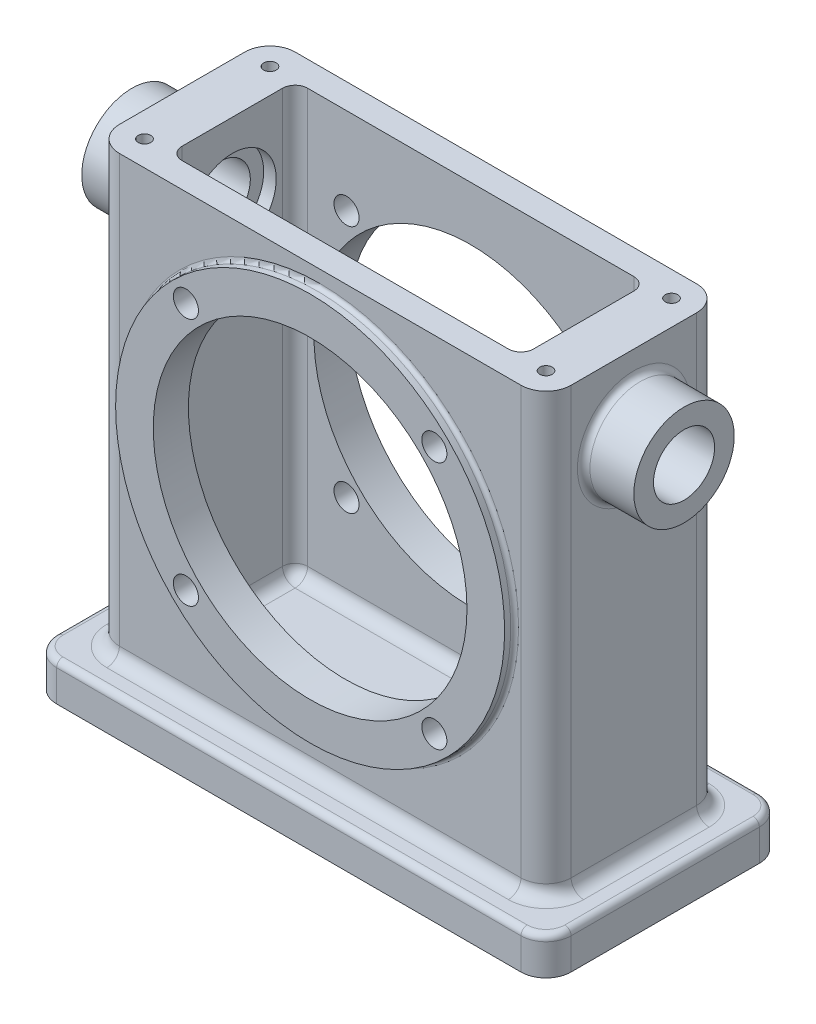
from build123d import *

# Parameters (mm, degrees)
SKETCH1_W           = 130.175
SKETCH1_H           = 60.325
BASE_EXTRUDE_DEPTH  = 9.525
SKETCH2_W           = 114.3
SKETCH2_H           = 44.45
BOSS_EXTRUDE1_DEPTH = 111.125
FILLET1_R           = 6.35
FILLET2_R           = 1.5875
FILLET3_R           = 3.175
CUT_EXTRUDE1_DEPTH  = 107.95
FILLET4_R           = 3.175
SKETCH4_R           = 49.2125
BOSS_EXTRUDE2_DEPTH = 2.54
SKETCH5_R           = 39.6875
CUT_EXTRUDE2_DEPTH  = 148.681533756
FILLET5_R           = 0.9906
SKETCH6_R           = 12.7
BOSS_EXTRUDE3_DEPTH = 12.7
SKETCH7_R           = 7.7343
CUT_EXTRUDE3_DEPTH  = 166.724659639
SKETCH8_R           = 11.1125
CUT_EXTRUDE4_DEPTH  = 3.175
FILLET6_R           = 1.5875
SKETCH9_R           = 3.175
CUT_EXTRUDE5_DEPTH  = 150.841500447
CIRPATTERN1_COUNT   = 4
SKETCH10_R          = 1.5875
CUT_EXTRUDE6_DEPTH  = 19.05


with BuildPart() as part:
    # Sketch1 → Base-Extrude (new body)
    with BuildSketch(Plane(origin=(0, 0, 0), x_dir=(1, 0, 0), z_dir=(0, 1, 0))):
        Rectangle(SKETCH1_W, SKETCH1_H)
    extrude(amount=BASE_EXTRUDE_DEPTH)

    # Sketch2 → Boss-Extrude1 (add)
    with BuildSketch(Plane(origin=(0, 9.525, 0), x_dir=(-1, 0, 0), z_dir=(0, 1, 0))):
        Rectangle(SKETCH2_W, SKETCH2_H)
    extrude(amount=BOSS_EXTRUDE1_DEPTH)

    # Fillet1
    fillet1_edges = [part.edges().sort_by_distance(p)[0] for p in [
        (-57.15, 65.0875, -22.225),
        (-57.15, 65.0875, 22.225),
        (57.15, 65.0875, 22.225),
        (57.15, 65.0875, -22.225),
        (-65.0875, 4.7625, -30.1625),
        (65.0875, 4.7625, -30.1625),
        (65.0875, 4.7625, 30.1625),
        (-65.0875, 4.7625, 30.1625),
    ]]
    fillet(fillet1_edges, radius=FILLET1_R)

    # Fillet2
    fillet2_edges = [part.edges().sort_by_distance(p)[0] for p in [
        (0, 9.525, 30.1625),
        (-65.0875, 9.525, 0),
        (65.0875, 9.525, 0),
        (0, 9.525, -30.1625),
        (-63.227628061, 9.525, -28.302628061),
        (63.227628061, 9.525, 28.302628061),
        (63.227628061, 9.525, -28.302628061),
        (-63.227628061, 9.525, 28.302628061),
    ]]
    fillet(fillet2_edges, radius=FILLET2_R)

    # Fillet3
    fillet3_edges = [part.edges().sort_by_distance(p)[0] for p in [
        (-57.15, 9.525, 0),
        (0, 9.525, -22.225),
        (57.15, 9.525, 0),
        (0, 9.525, 22.225),
        (-55.290128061, 9.525, 20.365128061),
        (-55.290128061, 9.525, -20.365128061),
        (55.290128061, 9.525, 20.365128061),
        (55.290128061, 9.525, -20.365128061),
    ]]
    fillet(fillet3_edges, radius=FILLET3_R)

    # Sketch3 → Cut-Extrude1 (cut)
    with BuildSketch(Plane(origin=(0, 120.65, 0), x_dir=(-1, 0, 0), z_dir=(0, 1, 0))):
        with BuildLine():
            Line((41.275, 15.875), (-41.275, 15.875))
            ThreePointArc((-41.275, 15.875), (-43.52006403, 14.94506403), (-44.45, 12.7))
            Line((-44.45, 12.7), (-44.45, -12.7))
            ThreePointArc((-44.45, -12.7), (-43.52006403, -14.94506403), (-41.275, -15.875))
            Line((-41.275, -15.875), (41.275, -15.875))
            ThreePointArc((41.275, -15.875), (43.52006403, -14.94506403), (44.45, -12.7))
            Line((44.45, -12.7), (44.45, 12.7))
            ThreePointArc((44.45, 12.7), (43.52006403, 14.94506403), (41.275, 15.875))
        make_face()
    extrude(amount=-CUT_EXTRUDE1_DEPTH, mode=Mode.SUBTRACT)

    # Fillet4
    fillet4_edges = [part.edges().sort_by_distance(p)[0] for p in [
        (43.52006403, 12.7, 14.94506403),
        (0, 12.7, 15.875),
        (-43.52006403, 12.7, 14.94506403),
        (-44.45, 12.7, 0),
        (-43.52006403, 12.7, -14.94506403),
        (0, 12.7, -15.875),
        (43.52006403, 12.7, -14.94506403),
        (44.45, 12.7, 0),
    ]]
    fillet(fillet4_edges, radius=FILLET4_R)

    # Sketch4 → Boss-Extrude2 (add)
    with BuildSketch(Plane.XY.offset(22.225)):
        with Locations(Location((0, 67.31, 0), (0, 0, 180))):
            Circle(SKETCH4_R)
    boss_extrude2 = extrude(amount=BOSS_EXTRUDE2_DEPTH)

    # Mirror1: Boss-Extrude2 across plane
    add(boss_extrude2.mirror(Plane.XY))

    # Sketch5 → Cut-Extrude2 (cut, through all)
    with BuildSketch(Plane.XY.offset(24.765)):
        with Locations((0, 67.31)):
            Circle(SKETCH5_R)
    extrude(amount=-CUT_EXTRUDE2_DEPTH, mode=Mode.SUBTRACT)

    # Fillet5
    fillet5_edges = [part.edges().sort_by_distance(p)[0] for p in [
        (49.2125, 67.31, 22.225),
        (49.2125, 67.31, -22.225),
    ]]
    fillet(fillet5_edges, radius=FILLET5_R)

    # Sketch6 → Boss-Extrude3 (add)
    with BuildSketch(Plane(origin=(57.15, 0, 0), x_dir=(0, 0, -1), z_dir=(1, 0, 0))):
        with Locations(Location((0, 101.6, 0), (0, 0, 180))):
            Circle(SKETCH6_R)
    boss_extrude3 = extrude(amount=BOSS_EXTRUDE3_DEPTH)

    # Sketch7 → Cut-Extrude3 (cut, through all)
    with BuildSketch(Plane.ZY.offset(-44.45)):
        with Locations((0, 101.6)):
            Circle(SKETCH7_R)
    cut_extrude3 = extrude(amount=-CUT_EXTRUDE3_DEPTH, mode=Mode.SUBTRACT)

    # Sketch8 → Cut-Extrude4 (cut)
    with BuildSketch(Plane.ZY.offset(-44.45)):
        with Locations((0, 101.6)):
            Circle(SKETCH8_R)
    cut_extrude4 = extrude(amount=-CUT_EXTRUDE4_DEPTH, mode=Mode.SUBTRACT)

    # Mirror3: Boss-Extrude3, Cut-Extrude3, Cut-Extrude4 across plane
    add(boss_extrude3.mirror(Plane(origin=(0, 0, 0), x_dir=(0, 0, 1), z_dir=(1, 0, 0))))
    add(cut_extrude3.mirror(Plane(origin=(0, 0, 0), x_dir=(0, 0, 1), z_dir=(1, 0, 0))), mode=Mode.SUBTRACT)
    add(cut_extrude4.mirror(Plane(origin=(0, 0, 0), x_dir=(0, 0, 1), z_dir=(1, 0, 0))), mode=Mode.SUBTRACT)

    # Fillet6
    fillet6_edges = [part.edges().sort_by_distance(p)[0] for p in [
        (57.15, 101.6, -12.7),
        (-57.15, 101.6, -12.7),
    ]]
    fillet(fillet6_edges, radius=FILLET6_R)

    # Sketch9 → Cut-Extrude5 (cut, through all)
    with BuildSketch(Plane.XY.offset(24.765)):
        with Locations((31.430896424, 98.740896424)):
            Circle(SKETCH9_R)
    cut_extrude5 = extrude(amount=-CUT_EXTRUDE5_DEPTH, mode=Mode.SUBTRACT)

    # CirPattern1: Cut-Extrude5 ×4 about axis
    cirpattern1_axis = Axis((0, 67.31, 0), (0, 0, 1))
    for i in range(1, CIRPATTERN1_COUNT):
        add(cut_extrude5.rotate(cirpattern1_axis, i * 360 / CIRPATTERN1_COUNT), mode=Mode.SUBTRACT)

    # Sketch10 → Cut-Extrude6 (cut)
    with BuildSketch(Plane(origin=(0, 120.65, 0), x_dir=(-1, 0, 0), z_dir=(0, 1, 0))):
        with Locations(Location((-50.8, -15.875, 0), (0, 0, 90))):
            Circle(SKETCH10_R)
        with Locations(Location((-50.8, 15.875, 0), (0, 0, 90))):
            Circle(SKETCH10_R)
    cut_extrude6 = extrude(amount=-CUT_EXTRUDE6_DEPTH, mode=Mode.SUBTRACT)

    # Mirror4: Cut-Extrude6 across plane
    add(cut_extrude6.mirror(Plane(origin=(0, 0, 0), x_dir=(0, 0, 1), z_dir=(1, 0, 0))), mode=Mode.SUBTRACT)


solid = part.part
